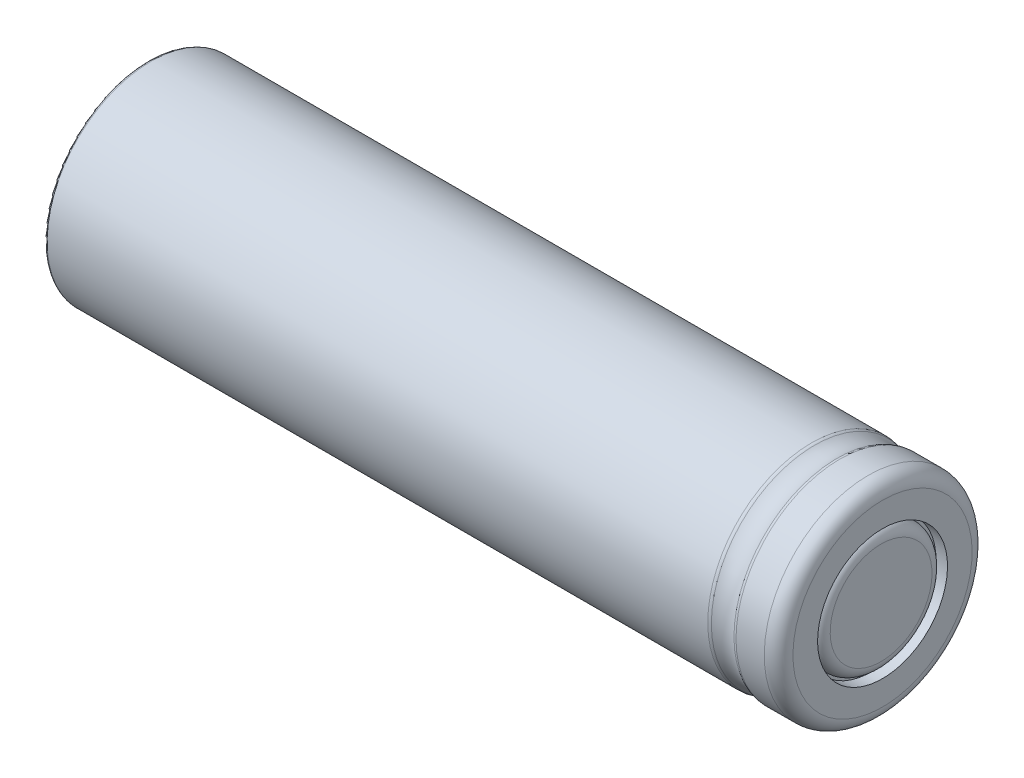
ISO-10303-21;
HEADER;
FILE_DESCRIPTION(('STEP AP214'),'2;1');
FILE_NAME('part.step','',(''),(''),'','','');
FILE_SCHEMA(('AUTOMOTIVE_DESIGN { 1 0 10303 214 1 1 1 1 }'));
ENDSEC;
DATA;
#1=APPLICATION_CONTEXT('core data for automotive mechanical design processes');
#2=APPLICATION_PROTOCOL_DEFINITION('international standard','automotive_design',2000,#1);
#3=PRODUCT_CONTEXT('',#1,'mechanical');
#4=PRODUCT('Part','Part','',(#3));
#5=PRODUCT_RELATED_PRODUCT_CATEGORY('part','',(#4));
#6=PRODUCT_DEFINITION_FORMATION('','',#4);
#7=PRODUCT_DEFINITION_CONTEXT('part definition',#1,'design');
#8=PRODUCT_DEFINITION('design','',#6,#7);
#9=PRODUCT_DEFINITION_SHAPE('','',#8);
#10=(LENGTH_UNIT() NAMED_UNIT(*) SI_UNIT(.MILLI.,.METRE.));
#11=(NAMED_UNIT(*) PLANE_ANGLE_UNIT() SI_UNIT($,.RADIAN.));
#12=(NAMED_UNIT(*) SI_UNIT($,.STERADIAN.) SOLID_ANGLE_UNIT());
#13=UNCERTAINTY_MEASURE_WITH_UNIT(LENGTH_MEASURE(1.E-05),#10,'distance_accuracy_value','');
#14=(GEOMETRIC_REPRESENTATION_CONTEXT(3) GLOBAL_UNCERTAINTY_ASSIGNED_CONTEXT((#13)) GLOBAL_UNIT_ASSIGNED_CONTEXT((#10,
#11,#12)) REPRESENTATION_CONTEXT('',''));
#15=CARTESIAN_POINT('',(0.,0.,0.));
#16=DIRECTION('',(0.,0.,1.));
#17=DIRECTION('',(1.,0.,0.));
#18=AXIS2_PLACEMENT_3D('',#15,#16,#17);
#19=CARTESIAN_POINT('',(63.984,0.,0.));
#20=DIRECTION('',(1.,0.,0.));
#21=DIRECTION('',(0.,1.,0.));
#22=AXIS2_PLACEMENT_3D('',#19,#20,#21);
#23=PLANE('',#22);
#24=CARTESIAN_POINT('',(63.984,0.,0.));
#25=DIRECTION('',(1.,0.,0.));
#26=DIRECTION('',(0.,1.,0.));
#27=AXIS2_PLACEMENT_3D('',#24,#25,#26);
#28=CIRCLE('',#27,5.75);
#29=CARTESIAN_POINT('',(63.984,5.75,0.));
#30=VERTEX_POINT('',#29);
#31=EDGE_CURVE('E77',#30,#30,#28,.T.);
#32=ORIENTED_EDGE('',*,*,#31,.T.);
#33=EDGE_LOOP('',(#32));
#34=FACE_BOUND('',#33,.T.);
#35=CARTESIAN_POINT('',(63.984,0.,0.));
#36=DIRECTION('',(1.,0.,0.));
#37=DIRECTION('',(0.,1.,0.));
#38=AXIS2_PLACEMENT_3D('',#35,#36,#37);
#39=CIRCLE('',#38,5.5);
#40=CARTESIAN_POINT('',(63.984,5.5,0.));
#41=VERTEX_POINT('',#40);
#42=EDGE_CURVE('E78',#41,#41,#39,.T.);
#43=ORIENTED_EDGE('',*,*,#42,.F.);
#44=EDGE_LOOP('',(#43));
#45=FACE_BOUND('',#44,.T.);
#46=ADVANCED_FACE('F41',(#34,#45),#23,.T.);
#47=CARTESIAN_POINT('',(65.,7.92999999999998,0.));
#48=DIRECTION('',(1.,0.,0.));
#49=DIRECTION('',(0.,1.,0.));
#50=AXIS2_PLACEMENT_3D('',#47,#48,#49);
#51=PLANE('',#50);
#52=CARTESIAN_POINT('',(65.,0.,0.));
#53=DIRECTION('',(1.,0.,0.));
#54=DIRECTION('',(0.,1.,0.));
#55=AXIS2_PLACEMENT_3D('',#52,#53,#54);
#56=CIRCLE('',#55,5.75);
#57=CARTESIAN_POINT('',(65.,5.75,0.));
#58=VERTEX_POINT('',#57);
#59=EDGE_CURVE('E80',#58,#58,#56,.T.);
#60=ORIENTED_EDGE('',*,*,#59,.F.);
#61=EDGE_LOOP('',(#60));
#62=FACE_BOUND('',#61,.T.);
#63=CARTESIAN_POINT('',(65.,0.,0.));
#64=DIRECTION('',(1.,0.,0.));
#65=DIRECTION('',(0.,1.,0.));
#66=AXIS2_PLACEMENT_3D('',#63,#64,#65);
#67=CIRCLE('',#66,7.92999999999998);
#68=CARTESIAN_POINT('',(65.,7.92999999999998,0.));
#69=VERTEX_POINT('',#68);
#70=EDGE_CURVE('E48',#69,#69,#67,.T.);
#71=ORIENTED_EDGE('',*,*,#70,.T.);
#72=EDGE_LOOP('',(#71));
#73=FACE_BOUND('',#72,.T.);
#74=ADVANCED_FACE('F147',(#62,#73),#51,.T.);
#75=CARTESIAN_POINT('',(63.73,0.,0.));
#76=DIRECTION('',(1.,0.,0.));
#77=DIRECTION('',(0.,1.,0.));
#78=AXIS2_PLACEMENT_3D('',#75,#76,#77);
#79=TOROIDAL_SURFACE('',#78,7.92999999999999,1.27);
#80=CARTESIAN_POINT('',(63.73,0.,0.));
#81=DIRECTION('',(1.,0.,0.));
#82=DIRECTION('',(0.,1.,0.));
#83=AXIS2_PLACEMENT_3D('',#80,#81,#82);
#84=CIRCLE('',#83,9.19999999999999);
#85=CARTESIAN_POINT('',(63.73,9.19999999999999,0.));
#86=VERTEX_POINT('',#85);
#87=EDGE_CURVE('E55',#86,#86,#84,.T.);
#88=ORIENTED_EDGE('',*,*,#87,.T.);
#89=EDGE_LOOP('',(#88));
#90=FACE_BOUND('',#89,.T.);
#91=ORIENTED_EDGE('',*,*,#70,.F.);
#92=EDGE_LOOP('',(#91));
#93=FACE_BOUND('',#92,.T.);
#94=ADVANCED_FACE('F142',(#90,#93),#79,.T.);
#95=CARTESIAN_POINT('',(65.,0.,0.));
#96=DIRECTION('',(1.,0.,0.));
#97=DIRECTION('',(0.,1.,0.));
#98=AXIS2_PLACEMENT_3D('',#95,#96,#97);
#99=CYLINDRICAL_SURFACE('',#98,9.19999999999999);
#100=CARTESIAN_POINT('',(61.23,0.,0.));
#101=DIRECTION('',(-1.,0.,0.));
#102=DIRECTION('',(0.,0.,1.));
#103=AXIS2_PLACEMENT_3D('',#100,#101,#102);
#104=CIRCLE('',#103,9.19999999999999);
#105=CARTESIAN_POINT('',(61.23,0.,9.19999999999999));
#106=VERTEX_POINT('',#105);
#107=EDGE_CURVE('E61',#106,#106,#104,.T.);
#108=ORIENTED_EDGE('',*,*,#107,.F.);
#109=EDGE_LOOP('',(#108));
#110=FACE_BOUND('',#109,.T.);
#111=ORIENTED_EDGE('',*,*,#87,.F.);
#112=EDGE_LOOP('',(#111));
#113=FACE_BOUND('',#112,.T.);
#114=ADVANCED_FACE('F118',(#110,#113),#99,.T.);
#115=CARTESIAN_POINT('',(61.23,0.,0.));
#116=DIRECTION('',(-1.,0.,0.));
#117=DIRECTION('',(0.,0.,1.));
#118=AXIS2_PLACEMENT_3D('',#115,#116,#117);
#119=TOROIDAL_SURFACE('',#118,8.69999999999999,0.500000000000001);
#120=CARTESIAN_POINT('',(60.98,0.,0.));
#121=DIRECTION('',(-1.,0.,0.));
#122=DIRECTION('',(0.,0.,1.));
#123=AXIS2_PLACEMENT_3D('',#120,#121,#122);
#124=CIRCLE('',#123,9.13301270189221);
#125=CARTESIAN_POINT('',(60.98,0.,9.13301270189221));
#126=VERTEX_POINT('',#125);
#127=EDGE_CURVE('E74',#126,#126,#124,.T.);
#128=ORIENTED_EDGE('',*,*,#127,.F.);
#129=EDGE_LOOP('',(#128));
#130=FACE_BOUND('',#129,.T.);
#131=ORIENTED_EDGE('',*,*,#107,.T.);
#132=EDGE_LOOP('',(#131));
#133=FACE_BOUND('',#132,.T.);
#134=ADVANCED_FACE('F123',(#130,#133),#119,.T.);
#135=CARTESIAN_POINT('',(58.73,0.,0.));
#136=DIRECTION('',(-1.,0.,0.));
#137=DIRECTION('',(0.,0.,1.));
#138=AXIS2_PLACEMENT_3D('',#135,#136,#137);
#139=TOROIDAL_SURFACE('',#138,8.69999999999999,0.5);
#140=CARTESIAN_POINT('',(58.73,0.,0.));
#141=DIRECTION('',(-1.,0.,0.));
#142=DIRECTION('',(0.,0.,1.));
#143=AXIS2_PLACEMENT_3D('',#140,#141,#142);
#144=CIRCLE('',#143,9.19999999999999);
#145=CARTESIAN_POINT('',(58.73,0.,9.19999999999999));
#146=VERTEX_POINT('',#145);
#147=EDGE_CURVE('E70',#146,#146,#144,.T.);
#148=ORIENTED_EDGE('',*,*,#147,.F.);
#149=EDGE_LOOP('',(#148));
#150=FACE_BOUND('',#149,.T.);
#151=CARTESIAN_POINT('',(58.98,0.,0.));
#152=DIRECTION('',(-1.,0.,0.));
#153=DIRECTION('',(0.,0.,1.));
#154=AXIS2_PLACEMENT_3D('',#151,#152,#153);
#155=CIRCLE('',#154,9.13301270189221);
#156=CARTESIAN_POINT('',(58.98,0.,9.13301270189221));
#157=VERTEX_POINT('',#156);
#158=EDGE_CURVE('E67',#157,#157,#155,.T.);
#159=ORIENTED_EDGE('',*,*,#158,.T.);
#160=EDGE_LOOP('',(#159));
#161=FACE_BOUND('',#160,.T.);
#162=ADVANCED_FACE('F125',(#150,#161),#139,.T.);
#163=CARTESIAN_POINT('',(59.98,0.,0.));
#164=DIRECTION('',(-1.,0.,0.));
#165=DIRECTION('',(0.,0.,1.));
#166=AXIS2_PLACEMENT_3D('',#163,#164,#165);
#167=TOROIDAL_SURFACE('',#166,10.8650635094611,2.);
#168=ORIENTED_EDGE('',*,*,#158,.F.);
#169=EDGE_LOOP('',(#168));
#170=FACE_BOUND('',#169,.T.);
#171=ORIENTED_EDGE('',*,*,#127,.T.);
#172=EDGE_LOOP('',(#171));
#173=FACE_BOUND('',#172,.T.);
#174=ADVANCED_FACE('F102',(#170,#173),#167,.F.);
#175=CARTESIAN_POINT('',(0.,0.,0.));
#176=DIRECTION('',(-1.,0.,0.));
#177=DIRECTION('',(0.,-1.,0.));
#178=AXIS2_PLACEMENT_3D('',#175,#176,#177);
#179=PLANE('',#178);
#180=CARTESIAN_POINT('',(0.,0.,0.));
#181=DIRECTION('',(-1.,0.,0.));
#182=DIRECTION('',(0.,-1.,0.));
#183=AXIS2_PLACEMENT_3D('',#180,#181,#182);
#184=CIRCLE('',#183,7.5);
#185=CARTESIAN_POINT('',(0.,-7.5,0.));
#186=VERTEX_POINT('',#185);
#187=EDGE_CURVE('E88',#186,#186,#184,.T.);
#188=ORIENTED_EDGE('',*,*,#187,.F.);
#189=EDGE_LOOP('',(#188));
#190=FACE_BOUND('',#189,.T.);
#191=CARTESIAN_POINT('',(0.,0.,0.));
#192=DIRECTION('',(1.,0.,0.));
#193=DIRECTION('',(0.,1.,0.));
#194=AXIS2_PLACEMENT_3D('',#191,#192,#193);
#195=CIRCLE('',#194,8.94599999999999);
#196=CARTESIAN_POINT('',(0.,8.94599999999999,0.));
#197=VERTEX_POINT('',#196);
#198=EDGE_CURVE('E62',#197,#197,#195,.T.);
#199=ORIENTED_EDGE('',*,*,#198,.F.);
#200=EDGE_LOOP('',(#199));
#201=FACE_BOUND('',#200,.T.);
#202=ADVANCED_FACE('F103',(#190,#201),#179,.T.);
#203=CARTESIAN_POINT('',(0.254,0.,0.));
#204=DIRECTION('',(1.,0.,0.));
#205=DIRECTION('',(0.,1.,0.));
#206=AXIS2_PLACEMENT_3D('',#203,#204,#205);
#207=TOROIDAL_SURFACE('',#206,8.94599999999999,0.254);
#208=ORIENTED_EDGE('',*,*,#198,.T.);
#209=EDGE_LOOP('',(#208));
#210=FACE_BOUND('',#209,.T.);
#211=CARTESIAN_POINT('',(0.254000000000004,0.,0.));
#212=DIRECTION('',(1.,0.,0.));
#213=DIRECTION('',(0.,1.,0.));
#214=AXIS2_PLACEMENT_3D('',#211,#212,#213);
#215=CIRCLE('',#214,9.19999999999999);
#216=CARTESIAN_POINT('',(0.254000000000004,9.19999999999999,0.));
#217=VERTEX_POINT('',#216);
#218=EDGE_CURVE('E57',#217,#217,#215,.T.);
#219=ORIENTED_EDGE('',*,*,#218,.F.);
#220=EDGE_LOOP('',(#219));
#221=FACE_BOUND('',#220,.T.);
#222=ADVANCED_FACE('F104',(#210,#221),#207,.T.);
#223=ORIENTED_EDGE('',*,*,#218,.T.);
#224=EDGE_LOOP('',(#223));
#225=FACE_BOUND('',#224,.T.);
#226=ORIENTED_EDGE('',*,*,#147,.T.);
#227=EDGE_LOOP('',(#226));
#228=FACE_BOUND('',#227,.T.);
#229=ADVANCED_FACE('F111',(#225,#228),#99,.T.);
#230=CARTESIAN_POINT('',(63.984,0.,0.));
#231=DIRECTION('',(1.,0.,0.));
#232=DIRECTION('',(0.,1.,0.));
#233=AXIS2_PLACEMENT_3D('',#230,#231,#232);
#234=CYLINDRICAL_SURFACE('',#233,5.75);
#235=ORIENTED_EDGE('',*,*,#31,.F.);
#236=EDGE_LOOP('',(#235));
#237=FACE_BOUND('',#236,.T.);
#238=ORIENTED_EDGE('',*,*,#59,.T.);
#239=EDGE_LOOP('',(#238));
#240=FACE_BOUND('',#239,.T.);
#241=ADVANCED_FACE('F120',(#237,#240),#234,.F.);
#242=CARTESIAN_POINT('',(64.873,7.92999999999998,0.));
#243=DIRECTION('',(1.,0.,0.));
#244=DIRECTION('',(0.,1.,0.));
#245=AXIS2_PLACEMENT_3D('',#242,#243,#244);
#246=PLANE('',#245);
#247=CARTESIAN_POINT('',(64.873,0.,0.));
#248=DIRECTION('',(1.,0.,0.));
#249=DIRECTION('',(0.,1.,0.));
#250=AXIS2_PLACEMENT_3D('',#247,#248,#249);
#251=CIRCLE('',#250,4.50617959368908);
#252=CARTESIAN_POINT('',(64.873,4.50617959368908,0.));
#253=VERTEX_POINT('',#252);
#254=EDGE_CURVE('E11',#253,#253,#251,.T.);
#255=ORIENTED_EDGE('',*,*,#254,.T.);
#256=EDGE_LOOP('',(#255));
#257=FACE_BOUND('',#256,.T.);
#258=ADVANCED_FACE('F97',(#257),#246,.T.);
#259=CARTESIAN_POINT('',(0.0254,0.,0.));
#260=DIRECTION('',(-1.,0.,0.));
#261=DIRECTION('',(0.,-1.,0.));
#262=AXIS2_PLACEMENT_3D('',#259,#260,#261);
#263=CYLINDRICAL_SURFACE('',#262,7.5);
#264=CARTESIAN_POINT('',(0.0254,0.,0.));
#265=DIRECTION('',(-1.,0.,0.));
#266=DIRECTION('',(0.,-1.,0.));
#267=AXIS2_PLACEMENT_3D('',#264,#265,#266);
#268=CIRCLE('',#267,7.5);
#269=CARTESIAN_POINT('',(0.0254000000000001,-7.5,0.));
#270=VERTEX_POINT('',#269);
#271=EDGE_CURVE('E83',#270,#270,#268,.T.);
#272=ORIENTED_EDGE('',*,*,#271,.F.);
#273=EDGE_LOOP('',(#272));
#274=FACE_BOUND('',#273,.T.);
#275=ORIENTED_EDGE('',*,*,#187,.T.);
#276=EDGE_LOOP('',(#275));
#277=FACE_BOUND('',#276,.T.);
#278=ADVANCED_FACE('F93',(#274,#277),#263,.F.);
#279=CARTESIAN_POINT('',(0.0254,0.,0.));
#280=DIRECTION('',(-1.,0.,0.));
#281=DIRECTION('',(0.,-1.,0.));
#282=AXIS2_PLACEMENT_3D('',#279,#280,#281);
#283=PLANE('',#282);
#284=ORIENTED_EDGE('',*,*,#271,.T.);
#285=EDGE_LOOP('',(#284));
#286=FACE_BOUND('',#285,.T.);
#287=ADVANCED_FACE('F92',(#286),#283,.T.);
#288=CARTESIAN_POINT('',(63.873,0.,0.));
#289=DIRECTION('',(-1.,0.,0.));
#290=DIRECTION('',(0.,-1.,0.));
#291=AXIS2_PLACEMENT_3D('',#288,#289,#290);
#292=TOROIDAL_SURFACE('',#291,4.50617959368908,1.);
#293=ORIENTED_EDGE('',*,*,#42,.T.);
#294=EDGE_LOOP('',(#293));
#295=FACE_BOUND('',#294,.T.);
#296=ORIENTED_EDGE('',*,*,#254,.F.);
#297=EDGE_LOOP('',(#296));
#298=FACE_BOUND('',#297,.T.);
#299=ADVANCED_FACE('F43',(#295,#298),#292,.T.);
#300=CLOSED_SHELL('',(#46,#74,#94,#114,#134,#162,#174,#202,#222,#229,#241,#258,#278,#287,#299));
#301=MANIFOLD_SOLID_BREP('B2',#300);
#302=ADVANCED_BREP_SHAPE_REPRESENTATION('',(#18,#301),#14);
#303=SHAPE_DEFINITION_REPRESENTATION(#9,#302);
ENDSEC;
END-ISO-10303-21;
